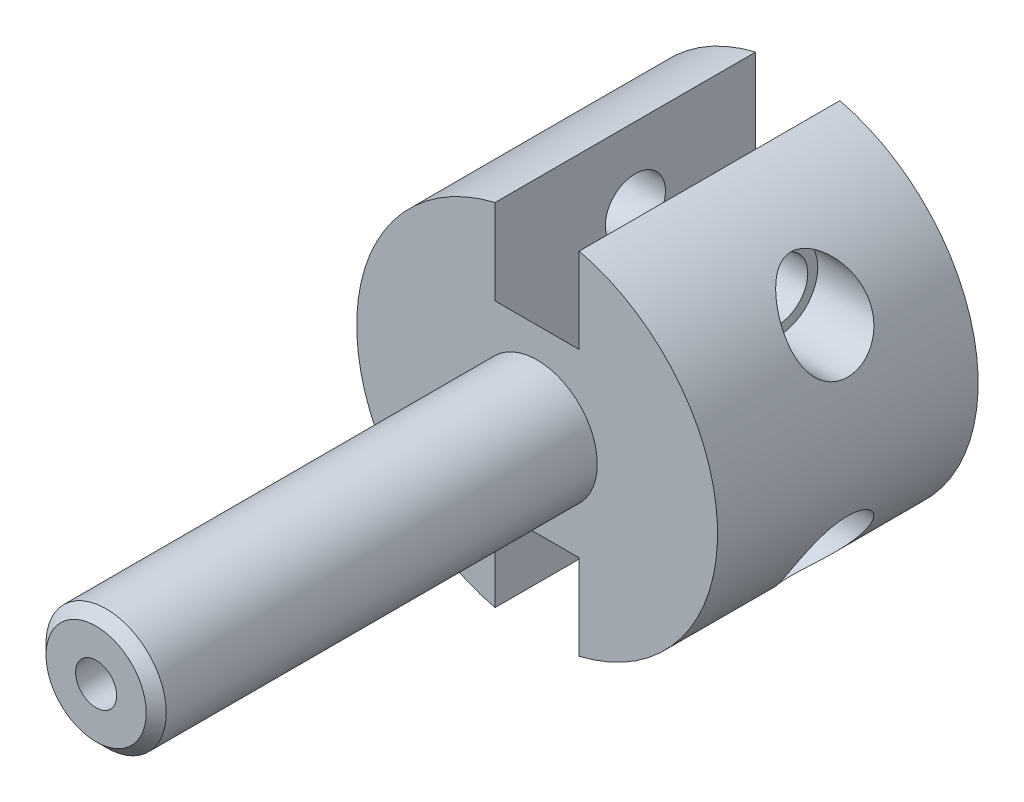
ISO-10303-21;
HEADER;
FILE_DESCRIPTION(('STEP AP214'),'2;1');
FILE_NAME('part.step','',(''),(''),'','','');
FILE_SCHEMA(('AUTOMOTIVE_DESIGN { 1 0 10303 214 1 1 1 1 }'));
ENDSEC;
DATA;
#1=APPLICATION_CONTEXT('core data for automotive mechanical design processes');
#2=APPLICATION_PROTOCOL_DEFINITION('international standard','automotive_design',2000,#1);
#3=PRODUCT_CONTEXT('',#1,'mechanical');
#4=PRODUCT('Part','Part','',(#3));
#5=PRODUCT_RELATED_PRODUCT_CATEGORY('part','',(#4));
#6=PRODUCT_DEFINITION_FORMATION('','',#4);
#7=PRODUCT_DEFINITION_CONTEXT('part definition',#1,'design');
#8=PRODUCT_DEFINITION('design','',#6,#7);
#9=PRODUCT_DEFINITION_SHAPE('','',#8);
#10=(LENGTH_UNIT() NAMED_UNIT(*) SI_UNIT(.MILLI.,.METRE.));
#11=(NAMED_UNIT(*) PLANE_ANGLE_UNIT() SI_UNIT($,.RADIAN.));
#12=(NAMED_UNIT(*) SI_UNIT($,.STERADIAN.) SOLID_ANGLE_UNIT());
#13=UNCERTAINTY_MEASURE_WITH_UNIT(LENGTH_MEASURE(1.E-05),#10,'distance_accuracy_value','');
#14=(GEOMETRIC_REPRESENTATION_CONTEXT(3) GLOBAL_UNCERTAINTY_ASSIGNED_CONTEXT((#13)) GLOBAL_UNIT_ASSIGNED_CONTEXT((#10,
#11,#12)) REPRESENTATION_CONTEXT('',''));
#15=CARTESIAN_POINT('',(0.,0.,0.));
#16=DIRECTION('',(0.,0.,1.));
#17=DIRECTION('',(1.,0.,0.));
#18=AXIS2_PLACEMENT_3D('',#15,#16,#17);
#19=CARTESIAN_POINT('',(0.,0.,13.));
#20=DIRECTION('',(0.,0.,-1.));
#21=DIRECTION('',(-1.,0.,0.));
#22=AXIS2_PLACEMENT_3D('',#19,#20,#21);
#23=CYLINDRICAL_SURFACE('',#22,9.);
#24=CARTESIAN_POINT('',(7.48331477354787,5.,8.00000000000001));
#25=CARTESIAN_POINT('',(7.56042868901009,4.88457943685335,7.99999716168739));
#26=CARTESIAN_POINT('',(7.63494225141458,4.76723290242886,7.98999700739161));
#27=CARTESIAN_POINT('',(7.77692478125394,4.53192590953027,7.94812711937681));
#28=CARTESIAN_POINT('',(7.84438550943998,4.4139648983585,7.91623212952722));
#29=CARTESIAN_POINT('',(7.97097336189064,4.18105832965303,7.82890347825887));
#30=CARTESIAN_POINT('',(8.03004176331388,4.06613820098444,7.77331389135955));
#31=CARTESIAN_POINT('',(8.13787516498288,3.84578079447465,7.63841848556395));
#32=CARTESIAN_POINT('',(8.18665146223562,3.74033319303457,7.55913890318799));
#33=CARTESIAN_POINT('',(8.26753766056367,3.55760051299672,7.39028982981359));
#34=CARTESIAN_POINT('',(8.30098898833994,3.478436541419,7.30339100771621));
#35=CARTESIAN_POINT('',(8.35941475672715,3.33558922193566,7.11519704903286));
#36=CARTESIAN_POINT('',(8.38439344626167,3.27189811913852,7.01390916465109));
#37=CARTESIAN_POINT('',(8.42413901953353,3.16807553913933,6.80991271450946));
#38=CARTESIAN_POINT('',(8.43962439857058,3.12633586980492,6.70815851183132));
#39=CARTESIAN_POINT('',(8.463905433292,3.05999416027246,6.49845715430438));
#40=CARTESIAN_POINT('',(8.47270280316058,3.03538772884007,6.39051159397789));
#41=CARTESIAN_POINT('',(8.48357985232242,3.00485057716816,6.17543972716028));
#42=CARTESIAN_POINT('',(8.48587721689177,2.99831484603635,6.06840976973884));
#43=CARTESIAN_POINT('',(8.48442437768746,3.00242375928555,5.85472477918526));
#44=CARTESIAN_POINT('',(8.48067465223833,3.01306704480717,5.74806971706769));
#45=CARTESIAN_POINT('',(8.46710744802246,3.0509812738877,5.53898920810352));
#46=CARTESIAN_POINT('',(8.45733547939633,3.07812748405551,5.4365381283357));
#47=CARTESIAN_POINT('',(8.43161208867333,3.14790255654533,5.2378862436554));
#48=CARTESIAN_POINT('',(8.41566084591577,3.19053096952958,5.14168525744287));
#49=CARTESIAN_POINT('',(8.37726485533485,3.29002813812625,4.95738432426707));
#50=CARTESIAN_POINT('',(8.35477061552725,3.34700496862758,4.86935313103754));
#51=CARTESIAN_POINT('',(8.30325356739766,3.47283596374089,4.70441763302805));
#52=CARTESIAN_POINT('',(8.27423035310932,3.54169086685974,4.62751402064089));
#53=CARTESIAN_POINT('',(8.20873927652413,3.69099309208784,4.4842388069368));
#54=CARTESIAN_POINT('',(8.1720698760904,3.77173185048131,4.41826393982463));
#55=CARTESIAN_POINT('',(8.09220221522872,3.94017150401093,4.30078897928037));
#56=CARTESIAN_POINT('',(8.04900244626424,4.02787400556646,4.24929223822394));
#57=CARTESIAN_POINT('',(7.95327976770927,4.21391068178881,4.15783547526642));
#58=CARTESIAN_POINT('',(7.90030838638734,4.31255492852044,4.11898014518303));
#59=CARTESIAN_POINT('',(7.78839643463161,4.51153375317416,4.05777089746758));
#60=CARTESIAN_POINT('',(7.72945294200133,4.61186913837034,4.03542510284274));
#61=CARTESIAN_POINT('',(7.59883909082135,4.82442672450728,4.00447367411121));
#62=CARTESIAN_POINT('',(7.52650272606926,4.93654263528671,3.99797003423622));
#63=CARTESIAN_POINT('',(7.37713481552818,5.15709833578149,4.00312619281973));
#64=CARTESIAN_POINT('',(7.30010184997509,5.2655369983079,4.01479151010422));
#65=CARTESIAN_POINT('',(7.12985126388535,5.49443159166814,4.05802533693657));
#66=CARTESIAN_POINT('',(7.03606700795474,5.6139011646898,4.09257170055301));
#67=CARTESIAN_POINT('',(6.84655010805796,5.84353930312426,4.1823957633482));
#68=CARTESIAN_POINT('',(6.75081392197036,5.95368866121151,4.23771505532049));
#69=CARTESIAN_POINT('',(6.60157124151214,6.1176599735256,4.33995613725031));
#70=CARTESIAN_POINT('',(6.54762775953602,6.17531678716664,4.38024063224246));
#71=CARTESIAN_POINT('',(6.44076110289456,6.28669568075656,4.46722156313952));
#72=CARTESIAN_POINT('',(6.38783831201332,6.34041630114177,4.51392035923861));
#73=CARTESIAN_POINT('',(6.28398109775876,6.44336220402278,4.61369783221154));
#74=CARTESIAN_POINT('',(6.23304247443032,6.49259731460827,4.66676194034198));
#75=CARTESIAN_POINT('',(6.13413449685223,6.58612333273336,4.77951936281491));
#76=CARTESIAN_POINT('',(6.08616257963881,6.63041853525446,4.83920682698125));
#77=CARTESIAN_POINT('',(5.99043481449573,6.71708403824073,4.97121025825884));
#78=CARTESIAN_POINT('',(5.94308620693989,6.7589231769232,5.04417915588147));
#79=CARTESIAN_POINT('',(5.85615706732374,6.83437878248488,5.19849870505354));
#80=CARTESIAN_POINT('',(5.81656334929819,6.86800923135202,5.27983476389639));
#81=CARTESIAN_POINT('',(5.75473679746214,6.91985044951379,5.43470971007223));
#82=CARTESIAN_POINT('',(5.73064939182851,6.93976056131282,5.50692435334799));
#83=CARTESIAN_POINT('',(5.69190477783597,6.97157496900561,5.65554689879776));
#84=CARTESIAN_POINT('',(5.67723798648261,6.98348740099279,5.73195045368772));
#85=CARTESIAN_POINT('',(5.65888838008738,6.99836652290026,5.88747175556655));
#86=CARTESIAN_POINT('',(5.65527590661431,7.00127592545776,5.96660365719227));
#87=CARTESIAN_POINT('',(5.65971150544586,6.99769046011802,6.12432404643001));
#88=CARTESIAN_POINT('',(5.66776083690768,6.99119457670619,6.20291247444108));
#89=CARTESIAN_POINT('',(5.6932256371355,6.97046694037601,6.34961706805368));
#90=CARTESIAN_POINT('',(5.70968290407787,6.95702524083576,6.41802055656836));
#91=CARTESIAN_POINT('',(5.74989923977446,6.92382405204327,6.55100409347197));
#92=CARTESIAN_POINT('',(5.77366175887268,6.90406157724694,6.61558231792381));
#93=CARTESIAN_POINT('',(5.84158220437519,6.84680929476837,6.7744858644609));
#94=CARTESIAN_POINT('',(5.88978076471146,6.80553970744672,6.86571899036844));
#95=CARTESIAN_POINT('',(5.99522252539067,6.71284396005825,7.0371673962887));
#96=CARTESIAN_POINT('',(6.05249120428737,6.66138908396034,7.11735041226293));
#97=CARTESIAN_POINT('',(6.19908195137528,6.52573360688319,7.30007485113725));
#98=CARTESIAN_POINT('',(6.2914097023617,6.43709379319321,7.39690272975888));
#99=CARTESIAN_POINT('',(6.48113895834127,6.24604465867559,7.5697061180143));
#100=CARTESIAN_POINT('',(6.57854744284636,6.1436160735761,7.64565199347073));
#101=CARTESIAN_POINT('',(6.77693742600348,5.92415253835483,7.77843092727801));
#102=CARTESIAN_POINT('',(6.87794506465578,5.80680164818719,7.83470213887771));
#103=CARTESIAN_POINT('',(7.07741286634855,5.56192675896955,7.92383253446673));
#104=CARTESIAN_POINT('',(7.17587956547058,5.43443323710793,7.95675911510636));
#105=CARTESIAN_POINT('',(7.30774990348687,5.25362571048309,7.9844861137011));
#106=CARTESIAN_POINT('',(7.3434956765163,5.20354413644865,7.99026065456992));
#107=CARTESIAN_POINT('',(7.4141048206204,5.10243604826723,7.99801919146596));
#108=CARTESIAN_POINT('',(7.44896773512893,5.0514090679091,8.00000126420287));
#109=CARTESIAN_POINT('',(7.48331477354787,5.,8.00000000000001));
#110=B_SPLINE_CURVE_WITH_KNOTS('',3,(#24,#25,#26,#27,#28,#29,#30,#31,#32,#33,#34,#35,#36,#37,
#38,#39,#40,#41,#42,#43,#44,#45,#46,#47,#48,#49,#50,#51,#52,#53,#54,#55,#56,#57,#58,#59,#60,#61,
#62,#63,#64,#65,#66,#67,#68,#69,#70,#71,#72,#73,#74,#75,#76,#77,#78,#79,#80,#81,#82,#83,#84,#85,
#86,#87,#88,#89,#90,#91,#92,#93,#94,#95,#96,#97,#98,#99,#100,#101,#102,#103,#104,#105,#106,#107,
#108,#109),.UNSPECIFIED.,.T.,.F.,(4,2,2,2,2,2,2,2,2,2,2,2,2,2,2,2,2,2,2,2,2,2,2,2,2,2,2,2,2,2,2,
2,2,2,2,2,2,2,2,2,2,2,4),(0.,0.416226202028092,0.832933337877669,1.25242606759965,
1.67145592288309,2.03610475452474,2.40057044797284,2.73212183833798,3.06358822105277,
3.38381434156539,3.70401513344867,4.02182534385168,4.33962633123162,4.65989665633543,
4.98018690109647,5.31032938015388,5.64054824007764,5.99466624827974,6.34895837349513,
6.74818315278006,7.14752922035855,7.61305150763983,8.07951090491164,8.34515856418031,
8.61090423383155,8.87605287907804,9.14096916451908,9.42970460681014,9.71794475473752,
9.95308092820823,10.1879775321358,10.4243657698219,10.6607795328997,10.874825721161,
11.0889731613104,11.4204760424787,11.7529272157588,12.2318485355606,12.7114460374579,
13.2037948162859,13.6947163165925,13.8800122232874,14.0654020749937),.UNSPECIFIED.);
#111=CARTESIAN_POINT('',(7.48331477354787,5.,8.00000000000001));
#112=VERTEX_POINT('',#111);
#113=EDGE_CURVE('E215',#112,#112,#110,.T.);
#114=ORIENTED_EDGE('',*,*,#113,.F.);
#115=EDGE_LOOP('',(#114));
#116=FACE_BOUND('',#115,.T.);
#117=CARTESIAN_POINT('',(0.,0.,13.));
#118=DIRECTION('',(0.,0.,1.));
#119=DIRECTION('',(1.,0.,0.));
#120=AXIS2_PLACEMENT_3D('',#117,#118,#119);
#121=CIRCLE('',#120,9.);
#122=CARTESIAN_POINT('',(2.1,-8.75157128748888,13.));
#123=VERTEX_POINT('',#122);
#124=CARTESIAN_POINT('',(2.1,8.75157128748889,13.));
#125=VERTEX_POINT('',#124);
#126=EDGE_CURVE('E200',#123,#125,#121,.T.);
#127=ORIENTED_EDGE('',*,*,#126,.F.);
#128=DIRECTION('',(0.,0.,-1.));
#129=VECTOR('',#128,1.);
#130=CARTESIAN_POINT('',(2.1,-8.75157128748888,13.));
#131=LINE('',#130,#129);
#132=CARTESIAN_POINT('',(2.1,-8.75157128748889,0.));
#133=VERTEX_POINT('',#132);
#134=EDGE_CURVE('E186',#123,#133,#131,.T.);
#135=ORIENTED_EDGE('',*,*,#134,.T.);
#136=CARTESIAN_POINT('',(0.,0.,0.));
#137=DIRECTION('',(0.,0.,1.));
#138=DIRECTION('',(1.,0.,0.));
#139=AXIS2_PLACEMENT_3D('',#136,#137,#138);
#140=CIRCLE('',#139,9.);
#141=CARTESIAN_POINT('',(2.1,8.75157128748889,0.));
#142=VERTEX_POINT('',#141);
#143=EDGE_CURVE('E196',#133,#142,#140,.T.);
#144=ORIENTED_EDGE('',*,*,#143,.T.);
#145=DIRECTION('',(0.,0.,-1.));
#146=VECTOR('',#145,1.);
#147=CARTESIAN_POINT('',(2.1,8.75157128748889,13.));
#148=LINE('',#147,#146);
#149=EDGE_CURVE('E50',#142,#125,#148,.F.);
#150=ORIENTED_EDGE('',*,*,#149,.T.);
#151=EDGE_LOOP('',(#127,#135,#144,#150));
#152=FACE_BOUND('',#151,.T.);
#153=CARTESIAN_POINT('',(7.48331477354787,-5.,8.00000000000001));
#154=CARTESIAN_POINT('',(7.38910161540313,-5.14098838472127,7.99999458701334));
#155=CARTESIAN_POINT('',(7.29074389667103,-5.27948342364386,7.98507200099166));
#156=CARTESIAN_POINT('',(7.08897924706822,-5.54749970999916,7.9285068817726));
#157=CARTESIAN_POINT('',(6.98555422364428,-5.67698409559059,7.88676100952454));
#158=CARTESIAN_POINT('',(6.77859010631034,-5.92251310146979,7.77951933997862));
#159=CARTESIAN_POINT('',(6.67506854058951,-6.03870526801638,7.71432640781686));
#160=CARTESIAN_POINT('',(6.47057821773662,-6.25730918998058,7.5610846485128));
#161=CARTESIAN_POINT('',(6.36960594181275,-6.35974089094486,7.47306945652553));
#162=CARTESIAN_POINT('',(6.2031998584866,-6.52148461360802,7.3018272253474));
#163=CARTESIAN_POINT('',(6.13579096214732,-6.58479892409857,7.22428486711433));
#164=CARTESIAN_POINT('',(6.00836450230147,-6.70126476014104,7.05645745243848));
#165=CARTESIAN_POINT('',(5.94833508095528,-6.75443266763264,6.96619335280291));
#166=CARTESIAN_POINT('',(5.85537728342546,-6.83500219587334,6.79926414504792));
#167=CARTESIAN_POINT('',(5.81954061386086,-6.8654659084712,6.72571442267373));
#168=CARTESIAN_POINT('',(5.75682412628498,-6.91813954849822,6.57210291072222));
#169=CARTESIAN_POINT('',(5.7299300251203,-6.94036264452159,6.4920517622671));
#170=CARTESIAN_POINT('',(5.69120457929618,-6.9721389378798,6.34012339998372));
#171=CARTESIAN_POINT('',(5.67764735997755,-6.98315412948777,6.26899941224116));
#172=CARTESIAN_POINT('',(5.66006742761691,-6.99741178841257,6.12482160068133));
#173=CARTESIAN_POINT('',(5.65603762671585,-7.00066003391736,6.05176925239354));
#174=CARTESIAN_POINT('',(5.65794897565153,-6.99911521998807,5.90582883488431));
#175=CARTESIAN_POINT('',(5.6638977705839,-6.99431599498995,5.83294093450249));
#176=CARTESIAN_POINT('',(5.68512755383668,-6.97706991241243,5.68946719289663));
#177=CARTESIAN_POINT('',(5.70041633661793,-6.96461666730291,5.6188833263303));
#178=CARTESIAN_POINT('',(5.74411548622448,-6.92864541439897,5.46303708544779));
#179=CARTESIAN_POINT('',(5.77495109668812,-6.90305046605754,5.37894253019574));
#180=CARTESIAN_POINT('',(5.84607952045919,-6.84291793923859,5.21830273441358));
#181=CARTESIAN_POINT('',(5.8863916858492,-6.80836204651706,5.14177340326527));
#182=CARTESIAN_POINT('',(5.99320830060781,-6.71479391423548,4.9638289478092));
#183=CARTESIAN_POINT('',(6.06333524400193,-6.65177442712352,4.86671598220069));
#184=CARTESIAN_POINT('',(6.21128466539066,-6.51385151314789,4.68812297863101));
#185=CARTESIAN_POINT('',(6.28912212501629,-6.43892477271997,4.60667431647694));
#186=CARTESIAN_POINT('',(6.47319152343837,-6.25455849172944,4.43591655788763));
#187=CARTESIAN_POINT('',(6.58079879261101,-6.14158865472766,4.3518830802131));
#188=CARTESIAN_POINT('',(6.79699786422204,-5.90144072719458,4.20921725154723));
#189=CARTESIAN_POINT('',(6.90559021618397,-5.77425419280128,4.15060009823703));
#190=CARTESIAN_POINT('',(7.12019798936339,-5.50746844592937,4.06031196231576));
#191=CARTESIAN_POINT('',(7.22619905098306,-5.36781417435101,4.02876776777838));
#192=CARTESIAN_POINT('',(7.43122012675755,-5.08015518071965,3.99639591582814));
#193=CARTESIAN_POINT('',(7.53025304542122,-4.93216685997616,3.99550990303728));
#194=CARTESIAN_POINT('',(7.69416629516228,-4.67090329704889,4.02405418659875));
#195=CARTESIAN_POINT('',(7.76137475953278,-4.55825117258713,4.04592134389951));
#196=CARTESIAN_POINT('',(7.88842902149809,-4.33464721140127,4.11034010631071));
#197=CARTESIAN_POINT('',(7.94827850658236,-4.22369454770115,4.15288129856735));
#198=CARTESIAN_POINT('',(8.05967741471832,-4.00706167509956,4.25967156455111));
#199=CARTESIAN_POINT('',(8.11117112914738,-3.90141985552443,4.32405814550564));
#200=CARTESIAN_POINT('',(8.20442001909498,-3.70130896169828,4.47389705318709));
#201=CARTESIAN_POINT('',(8.24618037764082,-3.60683395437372,4.55933811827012));
#202=CARTESIAN_POINT('',(8.31531817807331,-3.44418517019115,4.73812158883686));
#203=CARTESIAN_POINT('',(8.34379687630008,-3.37423666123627,4.82942825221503));
#204=CARTESIAN_POINT('',(8.39282467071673,-3.25037647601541,5.0242345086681));
#205=CARTESIAN_POINT('',(8.41337737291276,-3.19645750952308,5.12772852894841));
#206=CARTESIAN_POINT('',(8.44553224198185,-3.11045751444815,5.3356536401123));
#207=CARTESIAN_POINT('',(8.45767963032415,-3.07706646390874,5.43946113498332));
#208=CARTESIAN_POINT('',(8.47552751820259,-3.02756257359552,5.65164664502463));
#209=CARTESIAN_POINT('',(8.48122927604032,-3.01144636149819,5.76002376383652));
#210=CARTESIAN_POINT('',(8.48623214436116,-2.99731832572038,5.97531008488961));
#211=CARTESIAN_POINT('',(8.48569263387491,-2.99885568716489,6.08218633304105));
#212=CARTESIAN_POINT('',(8.47858726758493,-3.01888537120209,6.29412965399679));
#213=CARTESIAN_POINT('',(8.47202178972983,-3.03737663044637,6.39919683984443));
#214=CARTESIAN_POINT('',(8.45278367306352,-3.09050719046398,6.60415576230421));
#215=CARTESIAN_POINT('',(8.44013368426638,-3.12508658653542,6.70406518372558));
#216=CARTESIAN_POINT('',(8.40856800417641,-3.20904724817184,6.89638014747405));
#217=CARTESIAN_POINT('',(8.3896523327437,-3.25842846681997,6.98878571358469));
#218=CARTESIAN_POINT('',(8.34515135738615,-3.37077552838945,7.16475458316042));
#219=CARTESIAN_POINT('',(8.31948930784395,-3.43389614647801,7.24819947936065));
#220=CARTESIAN_POINT('',(8.26159216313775,-3.57094055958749,7.4030260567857));
#221=CARTESIAN_POINT('',(8.22935696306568,-3.64486452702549,7.47440754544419));
#222=CARTESIAN_POINT('',(8.15712256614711,-3.80384665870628,7.60632948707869));
#223=CARTESIAN_POINT('',(8.11687200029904,-3.88922415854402,7.66634602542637));
#224=CARTESIAN_POINT('',(8.02990516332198,-4.06574832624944,7.77136578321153));
#225=CARTESIAN_POINT('',(7.98318455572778,-4.15689884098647,7.81635886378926));
#226=CARTESIAN_POINT('',(7.87973410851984,-4.35003309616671,7.89454684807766));
#227=CARTESIAN_POINT('',(7.82249038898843,-4.45227760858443,7.92640765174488));
#228=CARTESIAN_POINT('',(7.70230614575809,-4.65709627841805,7.97318016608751));
#229=CARTESIAN_POINT('',(7.63937230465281,-4.7596699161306,7.98811148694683));
#230=CARTESIAN_POINT('',(7.54436915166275,-4.90770695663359,7.99841463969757));
#231=CARTESIAN_POINT('',(7.51406269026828,-4.95398626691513,8.00000176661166));
#232=CARTESIAN_POINT('',(7.48331477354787,-5.,8.00000000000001));
#233=B_SPLINE_CURVE_WITH_KNOTS('',3,(#153,#154,#155,#156,#157,#158,#159,#160,#161,#162,#163,
#164,#165,#166,#167,#168,#169,#170,#171,#172,#173,#174,#175,#176,#177,#178,#179,#180,#181,#182,
#183,#184,#185,#186,#187,#188,#189,#190,#191,#192,#193,#194,#195,#196,#197,#198,#199,#200,#201,
#202,#203,#204,#205,#206,#207,#208,#209,#210,#211,#212,#213,#214,#215,#216,#217,#218,#219,#220,
#221,#222,#223,#224,#225,#226,#227,#228,#229,#230,#231,#232),.UNSPECIFIED.,.T.,.F.,(4,2,2,2,2,2,
2,2,2,2,2,2,2,2,2,2,2,2,2,2,2,2,2,2,2,2,2,2,2,2,2,2,2,2,2,2,2,2,2,4),(0.,0.508550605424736,
1.01907229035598,1.52322340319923,2.02663568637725,2.38768653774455,2.7481494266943,
3.0091967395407,3.26982507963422,3.48857790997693,3.70716794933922,3.92592553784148,
4.1448659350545,4.42278408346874,4.7012747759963,5.10510891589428,5.50974370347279,
6.03871954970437,6.56801126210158,7.09976843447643,7.63051339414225,8.0278714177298,
8.42502951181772,8.82473540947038,9.22422797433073,9.57782052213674,9.9312520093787,
10.2588022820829,10.5862886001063,10.9054309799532,11.2245533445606,11.5424968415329,
11.8604393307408,12.1821681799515,12.5039021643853,12.8380372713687,13.1723974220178,
13.5352843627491,13.8977505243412,14.0637238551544),.UNSPECIFIED.);
#234=CARTESIAN_POINT('',(7.48331477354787,-5.,8.00000000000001));
#235=VERTEX_POINT('',#234);
#236=EDGE_CURVE('E34',#235,#235,#233,.T.);
#237=ORIENTED_EDGE('',*,*,#236,.F.);
#238=EDGE_LOOP('',(#237));
#239=FACE_BOUND('',#238,.T.);
#240=ADVANCED_FACE('F30',(#116,#152,#239),#23,.T.);
#241=CARTESIAN_POINT('',(-9.,-5.,6.00000000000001));
#242=DIRECTION('',(1.,0.,0.));
#243=DIRECTION('',(0.,0.,-1.));
#244=AXIS2_PLACEMENT_3D('',#241,#242,#243);
#245=CYLINDRICAL_SURFACE('',#244,1.5);
#246=CARTESIAN_POINT('',(2.09999999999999,-5.,6.00000000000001));
#247=DIRECTION('',(1.,0.,0.));
#248=DIRECTION('',(0.,0.,-1.));
#249=AXIS2_PLACEMENT_3D('',#246,#247,#248);
#250=CIRCLE('',#249,1.5);
#251=CARTESIAN_POINT('',(2.09999999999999,-5.,4.5));
#252=VERTEX_POINT('',#251);
#253=EDGE_CURVE('E131',#252,#252,#250,.T.);
#254=CARTESIAN_POINT('',(4.99999999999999,-5.,6.00000000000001));
#255=DIRECTION('',(1.,0.,0.));
#256=DIRECTION('',(0.,0.,-1.));
#257=AXIS2_PLACEMENT_3D('',#254,#255,#256);
#258=CIRCLE('',#257,1.5);
#259=CARTESIAN_POINT('',(4.99999999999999,-5.,4.5));
#260=VERTEX_POINT('',#259);
#261=EDGE_CURVE('E122',#260,#260,#258,.F.);
#262=CARTESIAN_POINT('',(2.09999999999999,-5.,4.5));
#263=CARTESIAN_POINT('',(2.13020833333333,-5.,4.5));
#264=CARTESIAN_POINT('',(2.16041666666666,-5.,4.5));
#265=CARTESIAN_POINT('',(2.22083333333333,-5.,4.5));
#266=CARTESIAN_POINT('',(2.25104166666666,-5.,4.5));
#267=CARTESIAN_POINT('',(2.31145833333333,-5.,4.5));
#268=CARTESIAN_POINT('',(2.34166666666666,-5.,4.5));
#269=CARTESIAN_POINT('',(2.40208333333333,-5.,4.5));
#270=CARTESIAN_POINT('',(2.43229166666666,-5.,4.5));
#271=CARTESIAN_POINT('',(2.49270833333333,-5.,4.5));
#272=CARTESIAN_POINT('',(2.52291666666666,-5.,4.5));
#273=CARTESIAN_POINT('',(2.58333333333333,-5.,4.5));
#274=CARTESIAN_POINT('',(2.61354166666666,-5.,4.5));
#275=CARTESIAN_POINT('',(2.67395833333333,-5.,4.5));
#276=CARTESIAN_POINT('',(2.70416666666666,-5.,4.5));
#277=CARTESIAN_POINT('',(2.76458333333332,-5.,4.5));
#278=CARTESIAN_POINT('',(2.79479166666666,-5.,4.5));
#279=CARTESIAN_POINT('',(2.85520833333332,-5.,4.5));
#280=CARTESIAN_POINT('',(2.88541666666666,-5.,4.5));
#281=CARTESIAN_POINT('',(2.94583333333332,-5.,4.5));
#282=CARTESIAN_POINT('',(2.97604166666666,-5.,4.5));
#283=CARTESIAN_POINT('',(3.03645833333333,-5.,4.5));
#284=CARTESIAN_POINT('',(3.06666666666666,-5.,4.5));
#285=CARTESIAN_POINT('',(3.12708333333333,-5.,4.5));
#286=CARTESIAN_POINT('',(3.15729166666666,-5.,4.5));
#287=CARTESIAN_POINT('',(3.21770833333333,-5.,4.5));
#288=CARTESIAN_POINT('',(3.24791666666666,-5.,4.5));
#289=CARTESIAN_POINT('',(3.30833333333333,-5.,4.5));
#290=CARTESIAN_POINT('',(3.33854166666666,-5.,4.5));
#291=CARTESIAN_POINT('',(3.39895833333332,-5.,4.5));
#292=CARTESIAN_POINT('',(3.42916666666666,-5.,4.5));
#293=CARTESIAN_POINT('',(3.48958333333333,-5.,4.5));
#294=CARTESIAN_POINT('',(3.51979166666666,-5.,4.5));
#295=CARTESIAN_POINT('',(3.58020833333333,-5.,4.5));
#296=CARTESIAN_POINT('',(3.61041666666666,-5.,4.5));
#297=CARTESIAN_POINT('',(3.67083333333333,-5.,4.5));
#298=CARTESIAN_POINT('',(3.70104166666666,-5.,4.5));
#299=CARTESIAN_POINT('',(3.76145833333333,-5.,4.5));
#300=CARTESIAN_POINT('',(3.79166666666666,-5.,4.5));
#301=CARTESIAN_POINT('',(3.85208333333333,-5.,4.5));
#302=CARTESIAN_POINT('',(3.88229166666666,-5.,4.5));
#303=CARTESIAN_POINT('',(3.94270833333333,-5.,4.5));
#304=CARTESIAN_POINT('',(3.97291666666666,-5.,4.5));
#305=CARTESIAN_POINT('',(4.03333333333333,-5.,4.5));
#306=CARTESIAN_POINT('',(4.06354166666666,-5.,4.5));
#307=CARTESIAN_POINT('',(4.12395833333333,-5.,4.5));
#308=CARTESIAN_POINT('',(4.15416666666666,-5.,4.5));
#309=CARTESIAN_POINT('',(4.21458333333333,-5.,4.5));
#310=CARTESIAN_POINT('',(4.24479166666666,-5.,4.5));
#311=CARTESIAN_POINT('',(4.30520833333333,-5.,4.5));
#312=CARTESIAN_POINT('',(4.33541666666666,-5.,4.5));
#313=CARTESIAN_POINT('',(4.39583333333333,-5.,4.5));
#314=CARTESIAN_POINT('',(4.42604166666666,-5.,4.5));
#315=CARTESIAN_POINT('',(4.48645833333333,-5.,4.5));
#316=CARTESIAN_POINT('',(4.51666666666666,-5.,4.5));
#317=CARTESIAN_POINT('',(4.57708333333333,-5.,4.5));
#318=CARTESIAN_POINT('',(4.60729166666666,-5.,4.5));
#319=CARTESIAN_POINT('',(4.66770833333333,-5.,4.5));
#320=CARTESIAN_POINT('',(4.69791666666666,-5.,4.5));
#321=CARTESIAN_POINT('',(4.75833333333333,-5.,4.5));
#322=CARTESIAN_POINT('',(4.78854166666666,-5.,4.5));
#323=CARTESIAN_POINT('',(4.84895833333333,-5.,4.5));
#324=CARTESIAN_POINT('',(4.87916666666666,-5.,4.5));
#325=CARTESIAN_POINT('',(4.93958333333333,-5.,4.5));
#326=CARTESIAN_POINT('',(4.96979166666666,-5.,4.5));
#327=CARTESIAN_POINT('',(4.99999999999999,-5.,4.5));
#328=B_SPLINE_CURVE_WITH_KNOTS('',3,(#262,#263,#264,#265,#266,#267,#268,#269,#270,#271,#272,
#273,#274,#275,#276,#277,#278,#279,#280,#281,#282,#283,#284,#285,#286,#287,#288,#289,#290,#291,
#292,#293,#294,#295,#296,#297,#298,#299,#300,#301,#302,#303,#304,#305,#306,#307,#308,#309,#310,
#311,#312,#313,#314,#315,#316,#317,#318,#319,#320,#321,#322,#323,#324,#325,#326,#327),
.UNSPECIFIED.,.F.,.F.,(4,2,2,2,2,2,2,2,2,2,2,2,2,2,2,2,2,2,2,2,2,2,2,2,2,2,2,2,2,2,2,2,4),(0.,
0.0906250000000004,0.181250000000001,0.271875,0.3625,0.453125,0.543750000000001,
0.634374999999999,0.724999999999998,0.815624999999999,0.906249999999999,0.996875,1.0875,
1.178125,1.26875,1.359375,1.45,1.540625,1.63125,1.721875,1.8125,1.903125,1.99375,2.084375,2.175,
2.265625,2.35625,2.446875,2.5375,2.628125,2.71875,2.809375,2.9),.UNSPECIFIED.);
#329=EDGE_CURVE('BSEAM148',#252,#260,#328,.T.);
#330=ORIENTED_EDGE('',*,*,#253,.F.);
#331=ORIENTED_EDGE('',*,*,#261,.F.);
#332=ORIENTED_EDGE('',*,*,#329,.T.);
#333=ORIENTED_EDGE('',*,*,#329,.F.);
#334=EDGE_LOOP('',(#330,#332,#331,#333));
#335=FACE_BOUND('',#334,.T.);
#336=ADVANCED_FACE('F148',(#335),#245,.F.);
#337=CARTESIAN_POINT('',(-9.,5.,6.00000000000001));
#338=DIRECTION('',(1.,0.,0.));
#339=DIRECTION('',(0.,0.,-1.));
#340=AXIS2_PLACEMENT_3D('',#337,#338,#339);
#341=CYLINDRICAL_SURFACE('',#340,1.5);
#342=CARTESIAN_POINT('',(2.1,5.,6.00000000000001));
#343=DIRECTION('',(1.,0.,0.));
#344=DIRECTION('',(0.,0.,-1.));
#345=AXIS2_PLACEMENT_3D('',#342,#343,#344);
#346=CIRCLE('',#345,1.5);
#347=CARTESIAN_POINT('',(2.1,5.,4.5));
#348=VERTEX_POINT('',#347);
#349=EDGE_CURVE('E137',#348,#348,#346,.T.);
#350=CARTESIAN_POINT('',(4.99999999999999,5.,6.00000000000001));
#351=DIRECTION('',(1.,0.,0.));
#352=DIRECTION('',(0.,0.,-1.));
#353=AXIS2_PLACEMENT_3D('',#350,#351,#352);
#354=CIRCLE('',#353,1.5);
#355=CARTESIAN_POINT('',(4.99999999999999,5.,4.5));
#356=VERTEX_POINT('',#355);
#357=EDGE_CURVE('E126',#356,#356,#354,.F.);
#358=CARTESIAN_POINT('',(2.1,5.,4.5));
#359=CARTESIAN_POINT('',(2.13020833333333,5.,4.5));
#360=CARTESIAN_POINT('',(2.16041666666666,5.,4.5));
#361=CARTESIAN_POINT('',(2.22083333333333,5.,4.5));
#362=CARTESIAN_POINT('',(2.25104166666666,5.,4.5));
#363=CARTESIAN_POINT('',(2.31145833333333,5.,4.5));
#364=CARTESIAN_POINT('',(2.34166666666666,5.,4.5));
#365=CARTESIAN_POINT('',(2.40208333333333,5.,4.5));
#366=CARTESIAN_POINT('',(2.43229166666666,5.,4.5));
#367=CARTESIAN_POINT('',(2.49270833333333,5.,4.5));
#368=CARTESIAN_POINT('',(2.52291666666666,5.,4.5));
#369=CARTESIAN_POINT('',(2.58333333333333,5.,4.5));
#370=CARTESIAN_POINT('',(2.61354166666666,5.,4.5));
#371=CARTESIAN_POINT('',(2.67395833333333,5.,4.5));
#372=CARTESIAN_POINT('',(2.70416666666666,5.,4.5));
#373=CARTESIAN_POINT('',(2.76458333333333,5.,4.5));
#374=CARTESIAN_POINT('',(2.79479166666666,5.,4.5));
#375=CARTESIAN_POINT('',(2.85520833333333,5.,4.5));
#376=CARTESIAN_POINT('',(2.88541666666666,5.,4.5));
#377=CARTESIAN_POINT('',(2.94583333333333,5.,4.5));
#378=CARTESIAN_POINT('',(2.97604166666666,5.,4.5));
#379=CARTESIAN_POINT('',(3.03645833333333,5.,4.5));
#380=CARTESIAN_POINT('',(3.06666666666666,5.,4.5));
#381=CARTESIAN_POINT('',(3.12708333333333,5.,4.5));
#382=CARTESIAN_POINT('',(3.15729166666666,5.,4.5));
#383=CARTESIAN_POINT('',(3.21770833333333,5.,4.5));
#384=CARTESIAN_POINT('',(3.24791666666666,5.,4.5));
#385=CARTESIAN_POINT('',(3.30833333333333,5.,4.5));
#386=CARTESIAN_POINT('',(3.33854166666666,5.,4.5));
#387=CARTESIAN_POINT('',(3.39895833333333,5.,4.5));
#388=CARTESIAN_POINT('',(3.42916666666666,5.,4.5));
#389=CARTESIAN_POINT('',(3.48958333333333,5.,4.5));
#390=CARTESIAN_POINT('',(3.51979166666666,5.,4.5));
#391=CARTESIAN_POINT('',(3.58020833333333,5.,4.5));
#392=CARTESIAN_POINT('',(3.61041666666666,5.,4.5));
#393=CARTESIAN_POINT('',(3.67083333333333,5.,4.5));
#394=CARTESIAN_POINT('',(3.70104166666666,5.,4.5));
#395=CARTESIAN_POINT('',(3.76145833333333,5.,4.5));
#396=CARTESIAN_POINT('',(3.79166666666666,5.,4.5));
#397=CARTESIAN_POINT('',(3.85208333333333,5.,4.5));
#398=CARTESIAN_POINT('',(3.88229166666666,5.,4.5));
#399=CARTESIAN_POINT('',(3.94270833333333,5.,4.5));
#400=CARTESIAN_POINT('',(3.97291666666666,5.,4.5));
#401=CARTESIAN_POINT('',(4.03333333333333,5.,4.5));
#402=CARTESIAN_POINT('',(4.06354166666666,5.,4.5));
#403=CARTESIAN_POINT('',(4.12395833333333,5.,4.5));
#404=CARTESIAN_POINT('',(4.15416666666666,5.,4.5));
#405=CARTESIAN_POINT('',(4.21458333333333,5.,4.5));
#406=CARTESIAN_POINT('',(4.24479166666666,5.,4.5));
#407=CARTESIAN_POINT('',(4.30520833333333,5.,4.5));
#408=CARTESIAN_POINT('',(4.33541666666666,5.,4.5));
#409=CARTESIAN_POINT('',(4.39583333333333,5.,4.5));
#410=CARTESIAN_POINT('',(4.42604166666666,5.,4.5));
#411=CARTESIAN_POINT('',(4.48645833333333,5.,4.5));
#412=CARTESIAN_POINT('',(4.51666666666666,5.,4.5));
#413=CARTESIAN_POINT('',(4.57708333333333,5.,4.5));
#414=CARTESIAN_POINT('',(4.60729166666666,5.,4.5));
#415=CARTESIAN_POINT('',(4.66770833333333,5.,4.5));
#416=CARTESIAN_POINT('',(4.69791666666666,5.,4.5));
#417=CARTESIAN_POINT('',(4.75833333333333,5.,4.5));
#418=CARTESIAN_POINT('',(4.78854166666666,5.,4.5));
#419=CARTESIAN_POINT('',(4.84895833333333,5.,4.5));
#420=CARTESIAN_POINT('',(4.87916666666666,5.,4.5));
#421=CARTESIAN_POINT('',(4.93958333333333,5.,4.5));
#422=CARTESIAN_POINT('',(4.96979166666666,5.,4.5));
#423=CARTESIAN_POINT('',(4.99999999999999,5.,4.5));
#424=B_SPLINE_CURVE_WITH_KNOTS('',3,(#358,#359,#360,#361,#362,#363,#364,#365,#366,#367,#368,
#369,#370,#371,#372,#373,#374,#375,#376,#377,#378,#379,#380,#381,#382,#383,#384,#385,#386,#387,
#388,#389,#390,#391,#392,#393,#394,#395,#396,#397,#398,#399,#400,#401,#402,#403,#404,#405,#406,
#407,#408,#409,#410,#411,#412,#413,#414,#415,#416,#417,#418,#419,#420,#421,#422,#423),
.UNSPECIFIED.,.F.,.F.,(4,2,2,2,2,2,2,2,2,2,2,2,2,2,2,2,2,2,2,2,2,2,2,2,2,2,2,2,2,2,2,2,4),(0.,
0.0906250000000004,0.181250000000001,0.271875,0.3625,0.453125,0.543749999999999,
0.634374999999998,0.724999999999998,0.815624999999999,0.906249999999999,0.996874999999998,
1.0875,1.178125,1.26875,1.359375,1.45,1.540625,1.63125,1.721875,1.8125,1.903125,1.99375,
2.084375,2.175,2.265625,2.35625,2.446875,2.5375,2.628125,2.71875,2.809375,2.9),.UNSPECIFIED.);
#425=EDGE_CURVE('BSEAM156',#348,#356,#424,.T.);
#426=ORIENTED_EDGE('',*,*,#349,.F.);
#427=ORIENTED_EDGE('',*,*,#357,.F.);
#428=ORIENTED_EDGE('',*,*,#425,.T.);
#429=ORIENTED_EDGE('',*,*,#425,.F.);
#430=EDGE_LOOP('',(#426,#428,#427,#429));
#431=FACE_BOUND('',#430,.T.);
#432=ADVANCED_FACE('F156',(#431),#341,.F.);
#433=CARTESIAN_POINT('',(0.,0.,13.));
#434=DIRECTION('',(0.,0.,1.));
#435=DIRECTION('',(1.,0.,0.));
#436=AXIS2_PLACEMENT_3D('',#433,#434,#435);
#437=PLANE('',#436);
#438=CARTESIAN_POINT('',(0.,0.,13.));
#439=DIRECTION('',(0.,0.,1.));
#440=DIRECTION('',(1.,0.,0.));
#441=AXIS2_PLACEMENT_3D('',#438,#439,#440);
#442=CIRCLE('',#441,3.);
#443=CARTESIAN_POINT('',(3.,0.,13.));
#444=VERTEX_POINT('',#443);
#445=EDGE_CURVE('E193',#444,#444,#442,.T.);
#446=ORIENTED_EDGE('',*,*,#445,.F.);
#447=EDGE_LOOP('',(#446));
#448=FACE_BOUND('',#447,.T.);
#449=CARTESIAN_POINT('',(-2.1,8.75157128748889,13.));
#450=VERTEX_POINT('',#449);
#451=CARTESIAN_POINT('',(-2.1,-8.75157128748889,13.));
#452=VERTEX_POINT('',#451);
#453=EDGE_CURVE('E203',#450,#452,#121,.T.);
#454=ORIENTED_EDGE('',*,*,#453,.T.);
#455=DIRECTION('',(0.,-1.,0.));
#456=VECTOR('',#455,1.);
#457=CARTESIAN_POINT('',(-2.1,-4.5,13.));
#458=LINE('',#457,#456);
#459=CARTESIAN_POINT('',(-2.1,-4.5,13.));
#460=VERTEX_POINT('',#459);
#461=EDGE_CURVE('E178',#460,#452,#458,.T.);
#462=ORIENTED_EDGE('',*,*,#461,.F.);
#463=DIRECTION('',(1.,0.,0.));
#464=VECTOR('',#463,1.);
#465=CARTESIAN_POINT('',(-2.1,-4.5,13.));
#466=LINE('',#465,#464);
#467=CARTESIAN_POINT('',(2.1,-4.5,13.));
#468=VERTEX_POINT('',#467);
#469=EDGE_CURVE('E181',#460,#468,#466,.T.);
#470=ORIENTED_EDGE('',*,*,#469,.T.);
#471=DIRECTION('',(0.,-1.,0.));
#472=VECTOR('',#471,1.);
#473=CARTESIAN_POINT('',(2.1,-4.5,13.));
#474=LINE('',#473,#472);
#475=EDGE_CURVE('E170',#468,#123,#474,.T.);
#476=ORIENTED_EDGE('',*,*,#475,.T.);
#477=ORIENTED_EDGE('',*,*,#126,.T.);
#478=DIRECTION('',(0.,-1.,0.));
#479=VECTOR('',#478,1.);
#480=CARTESIAN_POINT('',(2.1,9.,13.));
#481=LINE('',#480,#479);
#482=CARTESIAN_POINT('',(2.1,4.5,13.));
#483=VERTEX_POINT('',#482);
#484=EDGE_CURVE('E164',#125,#483,#481,.T.);
#485=ORIENTED_EDGE('',*,*,#484,.T.);
#486=DIRECTION('',(1.,0.,0.));
#487=VECTOR('',#486,1.);
#488=CARTESIAN_POINT('',(-2.1,4.5,13.));
#489=LINE('',#488,#487);
#490=CARTESIAN_POINT('',(-2.1,4.5,13.));
#491=VERTEX_POINT('',#490);
#492=EDGE_CURVE('E180',#491,#483,#489,.T.);
#493=ORIENTED_EDGE('',*,*,#492,.F.);
#494=DIRECTION('',(0.,-1.,0.));
#495=VECTOR('',#494,1.);
#496=CARTESIAN_POINT('',(-2.1,9.,13.));
#497=LINE('',#496,#495);
#498=EDGE_CURVE('E173',#450,#491,#497,.T.);
#499=ORIENTED_EDGE('',*,*,#498,.F.);
#500=EDGE_LOOP('',(#454,#462,#470,#476,#477,#485,#493,#499));
#501=FACE_BOUND('',#500,.T.);
#502=ADVANCED_FACE('F240',(#448,#501),#437,.T.);
#503=CARTESIAN_POINT('',(-7.48331477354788,-5.,4.5));
#504=CARTESIAN_POINT('',(-7.54323200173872,-4.91031672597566,4.50000332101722));
#505=CARTESIAN_POINT('',(-7.60159539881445,-4.81945071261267,4.50805038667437));
#506=CARTESIAN_POINT('',(-7.71376226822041,-4.63781208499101,4.54145196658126));
#507=CARTESIAN_POINT('',(-7.76755727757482,-4.54703993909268,4.56683784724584));
#508=CARTESIAN_POINT('',(-7.86941711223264,-4.3683979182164,4.63606987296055));
#509=CARTESIAN_POINT('',(-7.91744251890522,-4.28055067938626,4.68003465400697));
#510=CARTESIAN_POINT('',(-8.00593236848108,-4.11266873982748,4.78653757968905));
#511=CARTESIAN_POINT('',(-8.0464068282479,-4.03262375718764,4.84905082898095));
#512=CARTESIAN_POINT('',(-8.11383420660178,-3.89496872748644,4.98177524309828));
#513=CARTESIAN_POINT('',(-8.14187500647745,-3.83578874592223,5.04980674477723));
#514=CARTESIAN_POINT('',(-8.19099363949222,-3.72975167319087,5.1970798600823));
#515=CARTESIAN_POINT('',(-8.2120763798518,-3.68288590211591,5.27631351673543));
#516=CARTESIAN_POINT('',(-8.24501078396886,-3.6084996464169,5.43391414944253));
#517=CARTESIAN_POINT('',(-8.25763380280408,-3.57939657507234,5.51137700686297));
#518=CARTESIAN_POINT('',(-8.27705671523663,-3.5342529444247,5.67071046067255));
#519=CARTESIAN_POINT('',(-8.28385892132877,-3.5182071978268,5.75257929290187));
#520=CARTESIAN_POINT('',(-8.29138984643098,-3.50042007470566,5.91359962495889));
#521=CARTESIAN_POINT('',(-8.29242851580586,-3.49794877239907,5.99265703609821));
#522=CARTESIAN_POINT('',(-8.2892611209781,-3.50544817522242,6.1500669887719));
#523=CARTESIAN_POINT('',(-8.28505579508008,-3.51541712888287,6.22841962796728));
#524=CARTESIAN_POINT('',(-8.27151165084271,-3.54716558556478,6.38115455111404));
#525=CARTESIAN_POINT('',(-8.26224006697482,-3.56879035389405,6.45557512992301));
#526=CARTESIAN_POINT('',(-8.23867099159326,-3.62286691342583,6.59951306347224));
#527=CARTESIAN_POINT('',(-8.2243734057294,-3.65531890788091,6.66903032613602));
#528=CARTESIAN_POINT('',(-8.19055280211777,-3.73049167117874,6.8027087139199));
#529=CARTESIAN_POINT('',(-8.17093467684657,-3.77339773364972,6.86674128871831));
#530=CARTESIAN_POINT('',(-8.12682921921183,-3.86747211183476,6.9865004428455));
#531=CARTESIAN_POINT('',(-8.10234105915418,-3.91864183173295,7.04222560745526));
#532=CARTESIAN_POINT('',(-8.04734979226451,-4.03041442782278,7.14721415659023));
#533=CARTESIAN_POINT('',(-8.01659026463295,-4.0913809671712,7.19595480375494));
#534=CARTESIAN_POINT('',(-7.95051574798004,-4.2183437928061,7.28254668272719));
#535=CARTESIAN_POINT('',(-7.91519920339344,-4.2843417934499,7.32039418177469));
#536=CARTESIAN_POINT('',(-7.83695101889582,-4.42598643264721,7.38825861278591));
#537=CARTESIAN_POINT('',(-7.79361252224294,-4.50194591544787,7.41714990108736));
#538=CARTESIAN_POINT('',(-7.70300246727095,-4.6552875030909,7.46204173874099));
#539=CARTESIAN_POINT('',(-7.65572910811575,-4.73267024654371,7.47803634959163));
#540=CARTESIAN_POINT('',(-7.55141504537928,-4.89764228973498,7.49911747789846));
#541=CARTESIAN_POINT('',(-7.49392406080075,-4.98517552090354,7.50240664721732));
#542=CARTESIAN_POINT('',(-7.3762484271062,-5.15770228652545,7.49418907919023));
#543=CARTESIAN_POINT('',(-7.31606196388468,-5.24269404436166,7.48267222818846));
#544=CARTESIAN_POINT('',(-7.1853790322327,-5.4207214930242,7.44308156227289));
#545=CARTESIAN_POINT('',(-7.11466254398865,-5.51311459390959,7.41283174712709));
#546=CARTESIAN_POINT('',(-6.97348271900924,-5.69064205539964,7.33507107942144));
#547=CARTESIAN_POINT('',(-6.90301953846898,-5.77577249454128,7.28755097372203));
#548=CARTESIAN_POINT('',(-6.77254143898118,-5.92803721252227,7.18168882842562));
#549=CARTESIAN_POINT('',(-6.71222398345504,-5.99612173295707,7.12508729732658));
#550=CARTESIAN_POINT('',(-6.59650868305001,-6.12318661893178,6.99824314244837));
#551=CARTESIAN_POINT('',(-6.541103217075,-6.18218119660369,6.92802220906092));
#552=CARTESIAN_POINT('',(-6.45348242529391,-6.27338629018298,6.79560634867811));
#553=CARTESIAN_POINT('',(-6.41914661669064,-6.30844786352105,6.73678318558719));
#554=CARTESIAN_POINT('',(-6.35690368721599,-6.37116327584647,6.61217351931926));
#555=CARTESIAN_POINT('',(-6.32898685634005,-6.39882831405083,6.5463977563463));
#556=CARTESIAN_POINT('',(-6.2861627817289,-6.44087696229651,6.42120055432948));
#557=CARTESIAN_POINT('',(-6.26981581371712,-6.45675769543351,6.36278129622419));
#558=CARTESIAN_POINT('',(-6.24428301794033,-6.48145433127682,6.24294975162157));
#559=CARTESIAN_POINT('',(-6.23509122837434,-6.49027611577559,6.18154000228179));
#560=CARTESIAN_POINT('',(-6.2247313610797,-6.50021352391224,6.05714757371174));
#561=CARTESIAN_POINT('',(-6.22359697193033,-6.50129679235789,5.9941593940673));
#562=CARTESIAN_POINT('',(-6.22956527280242,-6.49557783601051,5.86893749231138));
#563=CARTESIAN_POINT('',(-6.23666955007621,-6.48877409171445,5.80670391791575));
#564=CARTESIAN_POINT('',(-6.25772204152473,-6.46847023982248,5.68859894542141));
#565=CARTESIAN_POINT('',(-6.27122801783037,-6.45540228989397,5.63257076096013));
#566=CARTESIAN_POINT('',(-6.30383586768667,-6.42356382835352,5.52389258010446));
#567=CARTESIAN_POINT('',(-6.32294034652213,-6.40479066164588,5.47124417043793));
#568=CARTESIAN_POINT('',(-6.37558649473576,-6.35246615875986,5.34630594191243));
#569=CARTESIAN_POINT('',(-6.41170914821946,-6.31610336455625,5.27627945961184));
#570=CARTESIAN_POINT('',(-6.49052685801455,-6.23508407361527,5.14529006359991));
#571=CARTESIAN_POINT('',(-6.53323737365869,-6.19040801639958,5.0843491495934));
#572=CARTESIAN_POINT('',(-6.63821852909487,-6.07797552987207,4.95221559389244));
#573=CARTESIAN_POINT('',(-6.70218368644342,-6.00755067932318,4.88464297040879));
#574=CARTESIAN_POINT('',(-6.83385281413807,-5.85734358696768,4.76542737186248));
#575=CARTESIAN_POINT('',(-6.90156149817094,-5.77754939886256,4.71380504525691));
#576=CARTESIAN_POINT('',(-7.03928128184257,-5.6089736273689,4.6258271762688));
#577=CARTESIAN_POINT('',(-7.10931187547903,-5.52005560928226,4.58976460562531));
#578=CARTESIAN_POINT('',(-7.24815515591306,-5.33642359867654,4.53509304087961));
#579=CARTESIAN_POINT('',(-7.31697077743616,-5.24172709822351,4.51643390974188));
#580=CARTESIAN_POINT('',(-7.41767437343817,-5.09721164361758,4.50237614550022));
#581=CARTESIAN_POINT('',(-7.450724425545,-5.04878077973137,4.49999819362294));
#582=CARTESIAN_POINT('',(-7.48331477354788,-5.,4.5));
#583=B_SPLINE_CURVE_WITH_KNOTS('',3,(#503,#504,#505,#506,#507,#508,#509,#510,#511,#512,#513,
#514,#515,#516,#517,#518,#519,#520,#521,#522,#523,#524,#525,#526,#527,#528,#529,#530,#531,#532,
#533,#534,#535,#536,#537,#538,#539,#540,#541,#542,#543,#544,#545,#546,#547,#548,#549,#550,#551,
#552,#553,#554,#555,#556,#557,#558,#559,#560,#561,#562,#563,#564,#565,#566,#567,#568,#569,#570,
#571,#572,#573,#574,#575,#576,#577,#578,#579,#580,#581,#582),.UNSPECIFIED.,.T.,.F.,(4,2,2,2,2,2,
2,2,2,2,2,2,2,2,2,2,2,2,2,2,2,2,2,2,2,2,2,2,2,2,2,2,2,2,2,2,2,2,2,4),(0.,0.323408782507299,
0.64740417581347,0.973500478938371,1.29916106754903,1.58084236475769,1.86232457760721,
2.11215964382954,2.3618954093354,2.59806039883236,2.83419214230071,3.0672637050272,
3.30033964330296,3.53789312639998,3.7754870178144,4.0261253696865,4.27684950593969,
4.55205838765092,4.82739392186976,5.14049969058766,5.45381944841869,5.81298310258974,
6.17233947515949,6.49258826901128,6.81233115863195,7.04139353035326,7.27010708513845,
7.4574571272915,7.64465089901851,7.83262688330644,8.02063908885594,8.19722345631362,
8.37389012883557,8.63278320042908,8.89229331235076,9.24054115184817,9.58923794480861,
9.94424067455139,10.2982174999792,10.4741269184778),.UNSPECIFIED.);
#584=CARTESIAN_POINT('',(-7.48331477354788,-5.,4.5));
#585=VERTEX_POINT('',#584);
#586=EDGE_CURVE('E130',#585,#585,#583,.T.);
#587=ORIENTED_EDGE('',*,*,#586,.T.);
#588=EDGE_LOOP('',(#587));
#589=FACE_BOUND('',#588,.T.);
#590=CARTESIAN_POINT('',(-7.48331477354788,5.,4.5));
#591=CARTESIAN_POINT('',(-7.41253741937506,5.10592406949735,4.5000007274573));
#592=CARTESIAN_POINT('',(-7.33947346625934,5.21036162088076,4.51121598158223));
#593=CARTESIAN_POINT('',(-7.19108441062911,5.41333302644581,4.55433260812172));
#594=CARTESIAN_POINT('',(-7.11575575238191,5.51185678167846,4.58626832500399));
#595=CARTESIAN_POINT('',(-6.96666223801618,5.69909799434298,4.66899290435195));
#596=CARTESIAN_POINT('',(-6.89289139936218,5.78794513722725,4.71947786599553));
#597=CARTESIAN_POINT('',(-6.74879461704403,5.95532539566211,4.8390045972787));
#598=CARTESIAN_POINT('',(-6.67846336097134,6.03387475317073,4.90801660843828));
#599=CARTESIAN_POINT('',(-6.56632723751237,6.15531762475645,5.04051255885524));
#600=CARTESIAN_POINT('',(-6.5224487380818,6.20170657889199,5.09905172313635));
#601=CARTESIAN_POINT('',(-6.44059434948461,6.28666857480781,5.22524270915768));
#602=CARTESIAN_POINT('',(-6.40260859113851,6.32525471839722,5.29287893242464));
#603=CARTESIAN_POINT('',(-6.34283262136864,6.38512808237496,5.4209894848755));
#604=CARTESIAN_POINT('',(-6.31931844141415,6.40835377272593,5.47974374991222));
#605=CARTESIAN_POINT('',(-6.27925080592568,6.4476196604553,5.60187954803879));
#606=CARTESIAN_POINT('',(-6.26269140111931,6.46366599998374,5.66525707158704));
#607=CARTESIAN_POINT('',(-6.23798159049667,6.48751830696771,5.7957518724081));
#608=CARTESIAN_POINT('',(-6.22990138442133,6.49525549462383,5.86289559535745));
#609=CARTESIAN_POINT('',(-6.22336331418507,6.50152096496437,5.99806894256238));
#610=CARTESIAN_POINT('',(-6.2249000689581,6.50005439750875,6.06609805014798));
#611=CARTESIAN_POINT('',(-6.23658778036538,6.48883797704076,6.19195430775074));
#612=CARTESIAN_POINT('',(-6.24563096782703,6.48015316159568,6.24998842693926));
#613=CARTESIAN_POINT('',(-6.2700986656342,6.45648132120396,6.36334502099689));
#614=CARTESIAN_POINT('',(-6.28552618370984,6.44149132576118,6.41866620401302));
#615=CARTESIAN_POINT('',(-6.32776891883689,6.40003715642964,6.54366132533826));
#616=CARTESIAN_POINT('',(-6.35666880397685,6.37140982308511,6.6119098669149));
#617=CARTESIAN_POINT('',(-6.4213430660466,6.3062245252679,6.74096647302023));
#618=CARTESIAN_POINT('',(-6.45713207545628,6.26964965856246,6.80175824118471));
#619=CARTESIAN_POINT('',(-6.54720186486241,6.17573813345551,6.9362602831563));
#620=CARTESIAN_POINT('',(-6.60349384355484,6.11567314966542,7.00671055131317));
#621=CARTESIAN_POINT('',(-6.72091516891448,5.98639793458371,7.13368594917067));
#622=CARTESIAN_POINT('',(-6.78204892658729,5.91717932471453,7.19019818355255));
#623=CARTESIAN_POINT('',(-6.90805612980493,5.76960930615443,7.2906783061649));
#624=CARTESIAN_POINT('',(-6.97298402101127,5.69107925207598,7.33431434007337));
#625=CARTESIAN_POINT('',(-7.10315802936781,5.52775424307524,7.40693444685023));
#626=CARTESIAN_POINT('',(-7.16840422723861,5.44295761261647,7.43591458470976));
#627=CARTESIAN_POINT('',(-7.30787000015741,5.25460169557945,7.48189550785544));
#628=CARTESIAN_POINT('',(-7.38185995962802,5.15020770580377,7.49624655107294));
#629=CARTESIAN_POINT('',(-7.52556594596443,4.93783734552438,7.5024611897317));
#630=CARTESIAN_POINT('',(-7.5952856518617,4.82986418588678,7.49434442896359));
#631=CARTESIAN_POINT('',(-7.71353340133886,4.63801842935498,7.4581842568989));
#632=CARTESIAN_POINT('',(-7.76335906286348,4.55404514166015,7.43489288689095));
#633=CARTESIAN_POINT('',(-7.85785907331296,4.38897134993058,7.37273705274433));
#634=CARTESIAN_POINT('',(-7.90253631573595,4.30786925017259,7.33388139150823));
#635=CARTESIAN_POINT('',(-7.98596036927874,4.15118941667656,7.24012329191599));
#636=CARTESIAN_POINT('',(-8.02466702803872,4.0756507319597,7.18511886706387));
#637=CARTESIAN_POINT('',(-8.09485523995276,3.9344055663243,7.05990320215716));
#638=CARTESIAN_POINT('',(-8.12634088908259,3.86869351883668,6.98970062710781));
#639=CARTESIAN_POINT('',(-8.17815161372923,3.75781142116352,6.84514254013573));
#640=CARTESIAN_POINT('',(-8.19935584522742,3.71113156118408,6.77225799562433));
#641=CARTESIAN_POINT('',(-8.2353338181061,3.63059682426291,6.61827860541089));
#642=CARTESIAN_POINT('',(-8.25011134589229,3.59673439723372,6.53718862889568));
#643=CARTESIAN_POINT('',(-8.27209281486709,3.54586844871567,6.37677961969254));
#644=CARTESIAN_POINT('',(-8.27984182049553,3.52765886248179,6.29791540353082));
#645=CARTESIAN_POINT('',(-8.28980944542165,3.5041728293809,6.13794798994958));
#646=CARTESIAN_POINT('',(-8.29202958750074,3.49889282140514,6.05684541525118));
#647=CARTESIAN_POINT('',(-8.29095024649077,3.5014486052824,5.89780494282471));
#648=CARTESIAN_POINT('',(-8.2878455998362,3.50882143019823,5.81985773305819));
#649=CARTESIAN_POINT('',(-8.27650383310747,3.53549030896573,5.66642356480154));
#650=CARTESIAN_POINT('',(-8.2682670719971,3.55478552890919,5.59093643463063));
#651=CARTESIAN_POINT('',(-8.24671160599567,3.60450768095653,5.44449893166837));
#652=CARTESIAN_POINT('',(-8.23339265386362,3.63493515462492,5.37354877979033));
#653=CARTESIAN_POINT('',(-8.20178374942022,3.70570355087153,5.23799974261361));
#654=CARTESIAN_POINT('',(-8.18349343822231,3.7460451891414,5.17340131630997));
#655=CARTESIAN_POINT('',(-8.14146118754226,3.83655716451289,5.05003048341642));
#656=CARTESIAN_POINT('',(-8.11756155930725,3.88700403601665,4.99151525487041));
#657=CARTESIAN_POINT('',(-8.06498961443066,3.99493972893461,4.88390530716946));
#658=CARTESIAN_POINT('',(-8.03631608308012,4.05243034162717,4.83481299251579));
#659=CARTESIAN_POINT('',(-7.97242169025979,4.17680635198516,4.7435294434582));
#660=CARTESIAN_POINT('',(-7.9368798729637,4.24406928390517,4.70207925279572));
#661=CARTESIAN_POINT('',(-7.86144296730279,4.3822274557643,4.63091130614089));
#662=CARTESIAN_POINT('',(-7.82154649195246,4.45312384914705,4.60119730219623));
#663=CARTESIAN_POINT('',(-7.73415857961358,4.60337096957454,4.5510231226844));
#664=CARTESIAN_POINT('',(-7.68630572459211,4.68288901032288,4.53169825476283));
#665=CARTESIAN_POINT('',(-7.58716194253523,4.84187794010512,4.50618196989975));
#666=CARTESIAN_POINT('',(-7.53586870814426,4.92134876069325,4.49999945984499));
#667=CARTESIAN_POINT('',(-7.48331477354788,5.,4.5));
#668=B_SPLINE_CURVE_WITH_KNOTS('',3,(#590,#591,#592,#593,#594,#595,#596,#597,#598,#599,#600,
#601,#602,#603,#604,#605,#606,#607,#608,#609,#610,#611,#612,#613,#614,#615,#616,#617,#618,#619,
#620,#621,#622,#623,#624,#625,#626,#627,#628,#629,#630,#631,#632,#633,#634,#635,#636,#637,#638,
#639,#640,#641,#642,#643,#644,#645,#646,#647,#648,#649,#650,#651,#652,#653,#654,#655,#656,#657,
#658,#659,#660,#661,#662,#663,#664,#665,#666,#667),.UNSPECIFIED.,.T.,.F.,(4,2,2,2,2,2,2,2,2,2,2,
2,2,2,2,2,2,2,2,2,2,2,2,2,2,2,2,2,2,2,2,2,2,2,2,2,2,2,4),(0.,0.381814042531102,0.76426256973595,
1.14070598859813,1.51654833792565,1.7756133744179,2.03423973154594,2.23571624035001,
2.43702004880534,2.63997762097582,2.8428216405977,3.02015278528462,3.19756756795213,
3.43461223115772,3.67216604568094,3.99548554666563,4.319103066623,4.65045003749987,
4.98188592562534,5.36621352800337,5.7502052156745,6.05012207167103,6.3498695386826,
6.65155232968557,6.95306357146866,7.21894674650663,7.48467305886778,7.72738658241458,
7.9700332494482,8.20398957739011,8.43792954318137,8.67188089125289,8.90584913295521,
9.14741201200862,9.38903645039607,9.64787874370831,9.90680372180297,10.1901181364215,
10.4736244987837),.UNSPECIFIED.);
#669=CARTESIAN_POINT('',(-7.48331477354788,5.,4.5));
#670=VERTEX_POINT('',#669);
#671=EDGE_CURVE('E159',#670,#670,#668,.T.);
#672=ORIENTED_EDGE('',*,*,#671,.T.);
#673=EDGE_LOOP('',(#672));
#674=FACE_BOUND('',#673,.T.);
#675=DIRECTION('',(0.,0.,-1.));
#676=VECTOR('',#675,1.);
#677=CARTESIAN_POINT('',(-2.1,-8.75157128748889,13.));
#678=LINE('',#677,#676);
#679=CARTESIAN_POINT('',(-2.1,-8.75157128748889,0.));
#680=VERTEX_POINT('',#679);
#681=EDGE_CURVE('E191',#452,#680,#678,.T.);
#682=ORIENTED_EDGE('',*,*,#681,.F.);
#683=ORIENTED_EDGE('',*,*,#453,.F.);
#684=DIRECTION('',(0.,0.,-1.));
#685=VECTOR('',#684,1.);
#686=CARTESIAN_POINT('',(-2.1,8.75157128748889,13.));
#687=LINE('',#686,#685);
#688=CARTESIAN_POINT('',(-2.1,8.75157128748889,0.));
#689=VERTEX_POINT('',#688);
#690=EDGE_CURVE('E189',#689,#450,#687,.F.);
#691=ORIENTED_EDGE('',*,*,#690,.F.);
#692=EDGE_CURVE('E199',#689,#680,#140,.T.);
#693=ORIENTED_EDGE('',*,*,#692,.T.);
#694=EDGE_LOOP('',(#682,#683,#691,#693));
#695=FACE_BOUND('',#694,.T.);
#696=ADVANCED_FACE('F231',(#589,#674,#695),#23,.T.);
#697=CARTESIAN_POINT('',(0.,0.,0.));
#698=DIRECTION('',(0.,0.,1.));
#699=DIRECTION('',(1.,0.,0.));
#700=AXIS2_PLACEMENT_3D('',#697,#698,#699);
#701=PLANE('',#700);
#702=CARTESIAN_POINT('',(-5.5,0.,0.));
#703=DIRECTION('',(0.,0.,-1.));
#704=DIRECTION('',(-1.,0.,0.));
#705=AXIS2_PLACEMENT_3D('',#702,#703,#704);
#706=CIRCLE('',#705,1.19999999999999);
#707=CARTESIAN_POINT('',(-6.69999999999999,0.,0.));
#708=VERTEX_POINT('',#707);
#709=EDGE_CURVE('E110',#708,#708,#706,.T.);
#710=ORIENTED_EDGE('',*,*,#709,.F.);
#711=EDGE_LOOP('',(#710));
#712=FACE_BOUND('',#711,.T.);
#713=DIRECTION('',(0.,1.,0.));
#714=VECTOR('',#713,1.);
#715=CARTESIAN_POINT('',(-2.1,0.,0.));
#716=LINE('',#715,#714);
#717=EDGE_CURVE('E11',#680,#689,#716,.T.);
#718=ORIENTED_EDGE('',*,*,#717,.F.);
#719=ORIENTED_EDGE('',*,*,#692,.F.);
#720=EDGE_LOOP('',(#718,#719));
#721=FACE_BOUND('',#720,.T.);
#722=ADVANCED_FACE('F239',(#712,#721),#701,.F.);
#723=CARTESIAN_POINT('',(5.49999999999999,0.,0.));
#724=DIRECTION('',(0.,0.,-1.));
#725=DIRECTION('',(-1.,0.,0.));
#726=AXIS2_PLACEMENT_3D('',#723,#724,#725);
#727=CIRCLE('',#726,1.19999999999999);
#728=CARTESIAN_POINT('',(4.30000000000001,0.,0.));
#729=VERTEX_POINT('',#728);
#730=EDGE_CURVE('E102',#729,#729,#727,.T.);
#731=ORIENTED_EDGE('',*,*,#730,.F.);
#732=EDGE_LOOP('',(#731));
#733=FACE_BOUND('',#732,.T.);
#734=ORIENTED_EDGE('',*,*,#143,.F.);
#735=DIRECTION('',(0.,1.,0.));
#736=VECTOR('',#735,1.);
#737=CARTESIAN_POINT('',(2.1,0.,0.));
#738=LINE('',#737,#736);
#739=EDGE_CURVE('E42',#133,#142,#738,.T.);
#740=ORIENTED_EDGE('',*,*,#739,.T.);
#741=EDGE_LOOP('',(#734,#740));
#742=FACE_BOUND('',#741,.T.);
#743=ADVANCED_FACE('F246',(#733,#742),#701,.F.);
#744=CARTESIAN_POINT('',(0.,0.,35.));
#745=DIRECTION('',(0.,0.,-1.));
#746=DIRECTION('',(-1.,0.,0.));
#747=AXIS2_PLACEMENT_3D('',#744,#745,#746);
#748=CYLINDRICAL_SURFACE('',#747,3.);
#749=CARTESIAN_POINT('',(0.,0.,34.5));
#750=DIRECTION('',(0.,0.,1.));
#751=DIRECTION('',(1.,0.,0.));
#752=AXIS2_PLACEMENT_3D('',#749,#750,#751);
#753=CIRCLE('',#752,3.);
#754=CARTESIAN_POINT('',(3.,0.,34.5));
#755=VERTEX_POINT('',#754);
#756=EDGE_CURVE('E207',#755,#755,#753,.F.);
#757=ORIENTED_EDGE('',*,*,#756,.T.);
#758=EDGE_LOOP('',(#757));
#759=FACE_BOUND('',#758,.T.);
#760=ORIENTED_EDGE('',*,*,#445,.T.);
#761=EDGE_LOOP('',(#760));
#762=FACE_BOUND('',#761,.T.);
#763=ADVANCED_FACE('F325',(#759,#762),#748,.T.);
#764=CARTESIAN_POINT('',(0.,0.,35.));
#765=DIRECTION('',(0.,0.,1.));
#766=DIRECTION('',(1.,0.,0.));
#767=AXIS2_PLACEMENT_3D('',#764,#765,#766);
#768=PLANE('',#767);
#769=CARTESIAN_POINT('',(0.,0.,35.));
#770=DIRECTION('',(0.,0.,1.));
#771=DIRECTION('',(1.,0.,0.));
#772=AXIS2_PLACEMENT_3D('',#769,#770,#771);
#773=CIRCLE('',#772,1.025);
#774=CARTESIAN_POINT('',(1.025,0.,35.));
#775=VERTEX_POINT('',#774);
#776=EDGE_CURVE('E116',#775,#775,#773,.T.);
#777=ORIENTED_EDGE('',*,*,#776,.F.);
#778=EDGE_LOOP('',(#777));
#779=FACE_BOUND('',#778,.T.);
#780=CARTESIAN_POINT('',(0.,0.,35.));
#781=DIRECTION('',(0.,0.,1.));
#782=DIRECTION('',(1.,0.,0.));
#783=AXIS2_PLACEMENT_3D('',#780,#781,#782);
#784=CIRCLE('',#783,2.5);
#785=CARTESIAN_POINT('',(2.5,0.,35.));
#786=VERTEX_POINT('',#785);
#787=EDGE_CURVE('E204',#786,#786,#784,.T.);
#788=ORIENTED_EDGE('',*,*,#787,.T.);
#789=EDGE_LOOP('',(#788));
#790=FACE_BOUND('',#789,.T.);
#791=ADVANCED_FACE('F329',(#779,#790),#768,.T.);
#792=CARTESIAN_POINT('',(0.,0.,35.));
#793=DIRECTION('',(0.,0.,-1.));
#794=DIRECTION('',(-1.,0.,0.));
#795=AXIS2_PLACEMENT_3D('',#792,#793,#794);
#796=CONICAL_SURFACE('',#795,2.5,0.785398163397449);
#797=ORIENTED_EDGE('',*,*,#756,.F.);
#798=EDGE_LOOP('',(#797));
#799=FACE_BOUND('',#798,.T.);
#800=ORIENTED_EDGE('',*,*,#787,.F.);
#801=EDGE_LOOP('',(#800));
#802=FACE_BOUND('',#801,.T.);
#803=ADVANCED_FACE('F277',(#799,#802),#796,.T.);
#804=CARTESIAN_POINT('',(-2.1,0.,19.));
#805=DIRECTION('',(1.,0.,0.));
#806=DIRECTION('',(0.,0.,-1.));
#807=AXIS2_PLACEMENT_3D('',#804,#805,#806);
#808=PLANE('',#807);
#809=CARTESIAN_POINT('',(-2.1,-5.,6.00000000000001));
#810=DIRECTION('',(1.,0.,0.));
#811=DIRECTION('',(0.,0.,-1.));
#812=AXIS2_PLACEMENT_3D('',#809,#810,#811);
#813=CIRCLE('',#812,1.5);
#814=CARTESIAN_POINT('',(-2.1,-5.,4.5));
#815=VERTEX_POINT('',#814);
#816=EDGE_CURVE('E127',#815,#815,#813,.T.);
#817=ORIENTED_EDGE('',*,*,#816,.F.);
#818=EDGE_LOOP('',(#817));
#819=FACE_BOUND('',#818,.T.);
#820=CARTESIAN_POINT('',(-2.1,5.,6.00000000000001));
#821=DIRECTION('',(1.,0.,0.));
#822=DIRECTION('',(0.,0.,-1.));
#823=AXIS2_PLACEMENT_3D('',#820,#821,#822);
#824=CIRCLE('',#823,1.5);
#825=CARTESIAN_POINT('',(-2.1,5.,4.5));
#826=VERTEX_POINT('',#825);
#827=EDGE_CURVE('E138',#826,#826,#824,.T.);
#828=ORIENTED_EDGE('',*,*,#827,.F.);
#829=EDGE_LOOP('',(#828));
#830=FACE_BOUND('',#829,.T.);
#831=ORIENTED_EDGE('',*,*,#681,.T.);
#832=ORIENTED_EDGE('',*,*,#717,.T.);
#833=ORIENTED_EDGE('',*,*,#690,.T.);
#834=ORIENTED_EDGE('',*,*,#498,.T.);
#835=CARTESIAN_POINT('',(-2.1,0.,19.));
#836=DIRECTION('',(-1.,0.,0.));
#837=DIRECTION('',(0.,0.,-1.));
#838=AXIS2_PLACEMENT_3D('',#835,#836,#837);
#839=CIRCLE('',#838,7.5);
#840=EDGE_CURVE('E175',#491,#460,#839,.T.);
#841=ORIENTED_EDGE('',*,*,#840,.T.);
#842=ORIENTED_EDGE('',*,*,#461,.T.);
#843=EDGE_LOOP('',(#831,#832,#833,#834,#841,#842));
#844=FACE_BOUND('',#843,.T.);
#845=ADVANCED_FACE('F264',(#819,#830,#844),#808,.T.);
#846=CARTESIAN_POINT('',(2.1,0.,19.));
#847=DIRECTION('',(1.,0.,0.));
#848=DIRECTION('',(0.,0.,-1.));
#849=AXIS2_PLACEMENT_3D('',#846,#847,#848);
#850=PLANE('',#849);
#851=ORIENTED_EDGE('',*,*,#253,.T.);
#852=EDGE_LOOP('',(#851));
#853=FACE_BOUND('',#852,.T.);
#854=ORIENTED_EDGE('',*,*,#349,.T.);
#855=EDGE_LOOP('',(#854));
#856=FACE_BOUND('',#855,.T.);
#857=ORIENTED_EDGE('',*,*,#475,.F.);
#858=CARTESIAN_POINT('',(2.1,0.,19.));
#859=DIRECTION('',(-1.,0.,0.));
#860=DIRECTION('',(0.,0.,-1.));
#861=AXIS2_PLACEMENT_3D('',#858,#859,#860);
#862=CIRCLE('',#861,7.5);
#863=EDGE_CURVE('E167',#483,#468,#862,.T.);
#864=ORIENTED_EDGE('',*,*,#863,.F.);
#865=ORIENTED_EDGE('',*,*,#484,.F.);
#866=ORIENTED_EDGE('',*,*,#149,.F.);
#867=ORIENTED_EDGE('',*,*,#739,.F.);
#868=ORIENTED_EDGE('',*,*,#134,.F.);
#869=EDGE_LOOP('',(#857,#864,#865,#866,#867,#868));
#870=FACE_BOUND('',#869,.T.);
#871=ADVANCED_FACE('F157',(#853,#856,#870),#850,.F.);
#872=CARTESIAN_POINT('',(-2.1,0.,19.));
#873=DIRECTION('',(1.,0.,0.));
#874=DIRECTION('',(0.,0.,-1.));
#875=AXIS2_PLACEMENT_3D('',#872,#873,#874);
#876=CYLINDRICAL_SURFACE('',#875,7.5);
#877=ORIENTED_EDGE('',*,*,#863,.T.);
#878=ORIENTED_EDGE('',*,*,#469,.F.);
#879=ORIENTED_EDGE('',*,*,#840,.F.);
#880=ORIENTED_EDGE('',*,*,#492,.T.);
#881=EDGE_LOOP('',(#877,#878,#879,#880));
#882=FACE_BOUND('',#881,.T.);
#883=ADVANCED_FACE('F154',(#882),#876,.T.);
#884=ORIENTED_EDGE('',*,*,#827,.T.);
#885=EDGE_LOOP('',(#884));
#886=FACE_BOUND('',#885,.T.);
#887=ORIENTED_EDGE('',*,*,#671,.F.);
#888=EDGE_LOOP('',(#887));
#889=FACE_BOUND('',#888,.T.);
#890=ADVANCED_FACE('F146',(#886,#889),#341,.F.);
#891=ORIENTED_EDGE('',*,*,#816,.T.);
#892=EDGE_LOOP('',(#891));
#893=FACE_BOUND('',#892,.T.);
#894=ORIENTED_EDGE('',*,*,#586,.F.);
#895=EDGE_LOOP('',(#894));
#896=FACE_BOUND('',#895,.T.);
#897=ADVANCED_FACE('F140',(#893,#896),#245,.F.);
#898=CARTESIAN_POINT('',(9.19999999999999,5.,6.00000000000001));
#899=DIRECTION('',(-1.,0.,0.));
#900=DIRECTION('',(0.,0.,1.));
#901=AXIS2_PLACEMENT_3D('',#898,#899,#900);
#902=CYLINDRICAL_SURFACE('',#901,2.);
#903=CARTESIAN_POINT('',(4.99999999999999,5.,6.00000000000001));
#904=DIRECTION('',(1.,0.,0.));
#905=DIRECTION('',(0.,0.,-1.));
#906=AXIS2_PLACEMENT_3D('',#903,#904,#905);
#907=CIRCLE('',#906,2.);
#908=CARTESIAN_POINT('',(4.99999999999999,5.,4.00000000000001));
#909=VERTEX_POINT('',#908);
#910=EDGE_CURVE('E123',#909,#909,#907,.T.);
#911=ORIENTED_EDGE('',*,*,#910,.F.);
#912=EDGE_LOOP('',(#911));
#913=FACE_BOUND('',#912,.T.);
#914=ORIENTED_EDGE('',*,*,#113,.T.);
#915=EDGE_LOOP('',(#914));
#916=FACE_BOUND('',#915,.T.);
#917=ADVANCED_FACE('F145',(#913,#916),#902,.F.);
#918=CARTESIAN_POINT('',(4.99999999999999,5.,6.00000000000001));
#919=DIRECTION('',(1.,0.,0.));
#920=DIRECTION('',(0.,0.,-1.));
#921=AXIS2_PLACEMENT_3D('',#918,#919,#920);
#922=PLANE('',#921);
#923=ORIENTED_EDGE('',*,*,#910,.T.);
#924=EDGE_LOOP('',(#923));
#925=FACE_BOUND('',#924,.T.);
#926=ORIENTED_EDGE('',*,*,#357,.T.);
#927=EDGE_LOOP('',(#926));
#928=FACE_BOUND('',#927,.T.);
#929=ADVANCED_FACE('F287',(#925,#928),#922,.T.);
#930=CARTESIAN_POINT('',(9.19999999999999,-5.,6.00000000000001));
#931=DIRECTION('',(-1.,0.,0.));
#932=DIRECTION('',(0.,0.,1.));
#933=AXIS2_PLACEMENT_3D('',#930,#931,#932);
#934=CYLINDRICAL_SURFACE('',#933,2.);
#935=CARTESIAN_POINT('',(4.99999999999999,-5.,6.00000000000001));
#936=DIRECTION('',(1.,0.,0.));
#937=DIRECTION('',(0.,0.,-1.));
#938=AXIS2_PLACEMENT_3D('',#935,#936,#937);
#939=CIRCLE('',#938,2.);
#940=CARTESIAN_POINT('',(4.99999999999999,-5.,4.00000000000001));
#941=VERTEX_POINT('',#940);
#942=EDGE_CURVE('E119',#941,#941,#939,.T.);
#943=ORIENTED_EDGE('',*,*,#942,.F.);
#944=EDGE_LOOP('',(#943));
#945=FACE_BOUND('',#944,.T.);
#946=ORIENTED_EDGE('',*,*,#236,.T.);
#947=EDGE_LOOP('',(#946));
#948=FACE_BOUND('',#947,.T.);
#949=ADVANCED_FACE('F227',(#945,#948),#934,.F.);
#950=CARTESIAN_POINT('',(4.99999999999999,-5.,6.00000000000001));
#951=DIRECTION('',(1.,0.,0.));
#952=DIRECTION('',(0.,0.,-1.));
#953=AXIS2_PLACEMENT_3D('',#950,#951,#952);
#954=PLANE('',#953);
#955=ORIENTED_EDGE('',*,*,#942,.T.);
#956=EDGE_LOOP('',(#955));
#957=FACE_BOUND('',#956,.T.);
#958=ORIENTED_EDGE('',*,*,#261,.T.);
#959=EDGE_LOOP('',(#958));
#960=FACE_BOUND('',#959,.T.);
#961=ADVANCED_FACE('F294',(#957,#960),#954,.T.);
#962=CARTESIAN_POINT('',(0.,0.,35.));
#963=DIRECTION('',(0.,0.,1.));
#964=DIRECTION('',(1.,0.,0.));
#965=AXIS2_PLACEMENT_3D('',#962,#963,#964);
#966=CYLINDRICAL_SURFACE('',#965,1.025);
#967=CARTESIAN_POINT('',(0.,0.,27.75));
#968=DIRECTION('',(0.,0.,1.));
#969=DIRECTION('',(1.,0.,0.));
#970=AXIS2_PLACEMENT_3D('',#967,#968,#969);
#971=CIRCLE('',#970,1.025);
#972=CARTESIAN_POINT('',(1.025,0.,27.75));
#973=VERTEX_POINT('',#972);
#974=EDGE_CURVE('E113',#973,#973,#971,.T.);
#975=ORIENTED_EDGE('',*,*,#974,.F.);
#976=EDGE_LOOP('',(#975));
#977=FACE_BOUND('',#976,.T.);
#978=ORIENTED_EDGE('',*,*,#776,.T.);
#979=EDGE_LOOP('',(#978));
#980=FACE_BOUND('',#979,.T.);
#981=ADVANCED_FACE('F301',(#977,#980),#966,.F.);
#982=CARTESIAN_POINT('',(0.,0.,27.75));
#983=DIRECTION('',(0.,0.,1.));
#984=DIRECTION('',(1.,0.,0.));
#985=AXIS2_PLACEMENT_3D('',#982,#983,#984);
#986=CONICAL_SURFACE('',#985,1.025,1.02974425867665);
#987=CARTESIAN_POINT('',(0.,0.,27.1341178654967));
#988=VERTEX_POINT('',#987);
#989=VERTEX_LOOP('',#988);
#990=FACE_BOUND('',#989,.T.);
#991=ORIENTED_EDGE('',*,*,#974,.T.);
#992=EDGE_LOOP('',(#991));
#993=FACE_BOUND('',#992,.T.);
#994=ADVANCED_FACE('F305',(#990,#993),#986,.F.);
#995=CARTESIAN_POINT('',(-5.5,0.,0.));
#996=DIRECTION('',(0.,0.,-1.));
#997=DIRECTION('',(-1.,0.,0.));
#998=AXIS2_PLACEMENT_3D('',#995,#996,#997);
#999=CYLINDRICAL_SURFACE('',#998,1.19999999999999);
#1000=CARTESIAN_POINT('',(-5.5,0.,10.5));
#1001=DIRECTION('',(0.,0.,-1.));
#1002=DIRECTION('',(-1.,0.,0.));
#1003=AXIS2_PLACEMENT_3D('',#1000,#1001,#1002);
#1004=CIRCLE('',#1003,1.2);
#1005=CARTESIAN_POINT('',(-6.7,0.,10.5));
#1006=VERTEX_POINT('',#1005);
#1007=EDGE_CURVE('E105',#1006,#1006,#1004,.T.);
#1008=ORIENTED_EDGE('',*,*,#1007,.F.);
#1009=EDGE_LOOP('',(#1008));
#1010=FACE_BOUND('',#1009,.T.);
#1011=ORIENTED_EDGE('',*,*,#709,.T.);
#1012=EDGE_LOOP('',(#1011));
#1013=FACE_BOUND('',#1012,.T.);
#1014=ADVANCED_FACE('F309',(#1010,#1013),#999,.F.);
#1015=CARTESIAN_POINT('',(-5.5,0.,10.5));
#1016=DIRECTION('',(0.,0.,-1.));
#1017=DIRECTION('',(-1.,0.,0.));
#1018=AXIS2_PLACEMENT_3D('',#1015,#1016,#1017);
#1019=CONICAL_SURFACE('',#1018,1.2,1.02974425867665);
#1020=CARTESIAN_POINT('',(-5.50000000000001,0.,11.2210327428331));
#1021=VERTEX_POINT('',#1020);
#1022=VERTEX_LOOP('',#1021);
#1023=FACE_BOUND('',#1022,.T.);
#1024=ORIENTED_EDGE('',*,*,#1007,.T.);
#1025=EDGE_LOOP('',(#1024));
#1026=FACE_BOUND('',#1025,.T.);
#1027=ADVANCED_FACE('F313',(#1023,#1026),#1019,.F.);
#1028=CARTESIAN_POINT('',(5.49999999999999,0.,0.));
#1029=DIRECTION('',(0.,0.,-1.));
#1030=DIRECTION('',(-1.,0.,0.));
#1031=AXIS2_PLACEMENT_3D('',#1028,#1029,#1030);
#1032=CYLINDRICAL_SURFACE('',#1031,1.19999999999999);
#1033=CARTESIAN_POINT('',(5.49999999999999,0.,10.5));
#1034=DIRECTION('',(0.,0.,-1.));
#1035=DIRECTION('',(-1.,0.,0.));
#1036=AXIS2_PLACEMENT_3D('',#1033,#1034,#1035);
#1037=CIRCLE('',#1036,1.2);
#1038=CARTESIAN_POINT('',(4.3,0.,10.5));
#1039=VERTEX_POINT('',#1038);
#1040=EDGE_CURVE('E100',#1039,#1039,#1037,.T.);
#1041=ORIENTED_EDGE('',*,*,#1040,.F.);
#1042=EDGE_LOOP('',(#1041));
#1043=FACE_BOUND('',#1042,.T.);
#1044=ORIENTED_EDGE('',*,*,#730,.T.);
#1045=EDGE_LOOP('',(#1044));
#1046=FACE_BOUND('',#1045,.T.);
#1047=ADVANCED_FACE('F96',(#1043,#1046),#1032,.F.);
#1048=CARTESIAN_POINT('',(5.49999999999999,0.,10.5));
#1049=DIRECTION('',(0.,0.,-1.));
#1050=DIRECTION('',(-1.,0.,0.));
#1051=AXIS2_PLACEMENT_3D('',#1048,#1049,#1050);
#1052=CONICAL_SURFACE('',#1051,1.2,1.02974425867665);
#1053=CARTESIAN_POINT('',(5.49999999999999,0.,11.2210327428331));
#1054=VERTEX_POINT('',#1053);
#1055=VERTEX_LOOP('',#1054);
#1056=FACE_BOUND('',#1055,.T.);
#1057=ORIENTED_EDGE('',*,*,#1040,.T.);
#1058=EDGE_LOOP('',(#1057));
#1059=FACE_BOUND('',#1058,.T.);
#1060=ADVANCED_FACE('F93',(#1056,#1059),#1052,.F.);
#1061=CLOSED_SHELL('',(#240,#336,#432,#502,#696,#722,#743,#763,#791,#803,#845,#871,#883,#890,
#897,#917,#929,#949,#961,#981,#994,#1014,#1027,#1047,#1060));
#1062=MANIFOLD_SOLID_BREP('B2',#1061);
#1063=ADVANCED_BREP_SHAPE_REPRESENTATION('',(#18,#1062),#14);
#1064=SHAPE_DEFINITION_REPRESENTATION(#9,#1063);
ENDSEC;
END-ISO-10303-21;
